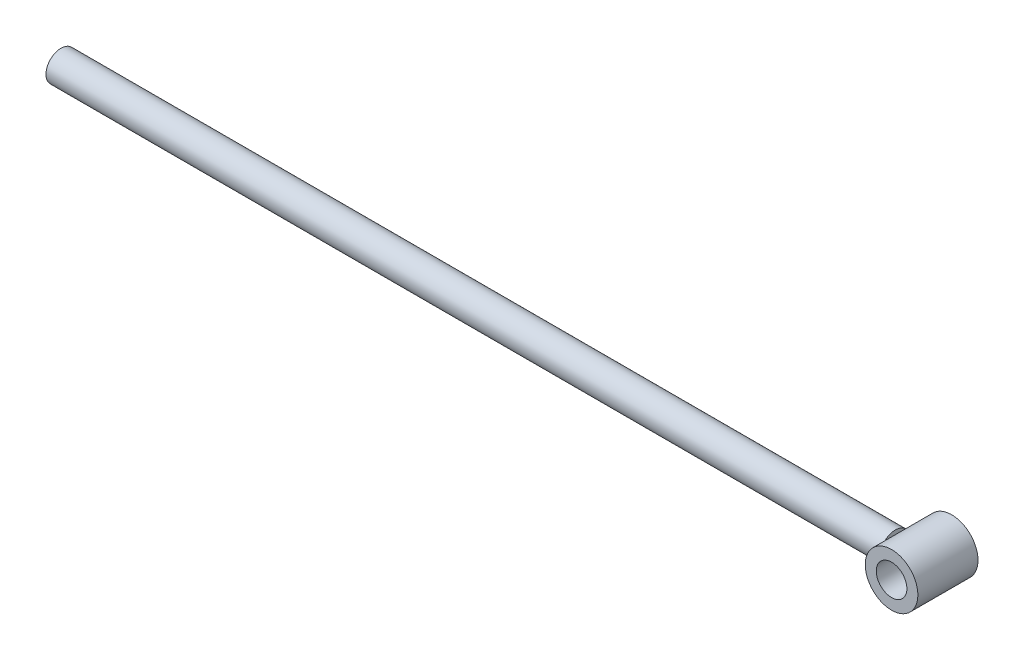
from build123d import *

# Parameters (mm, degrees)
ESQUISSE1_R      = 10
EXTRUSION1_DEPTH = 555
ESQUISSE2_R      = 17.5
ESQUISSE2_R_2    = 10.2
EXTRUSION2_DEPTH = 20


with BuildPart() as part:
    # Esquisse1 → Extrusion1 (new body)
    with BuildSketch(Plane(origin=(0, 0, 0), x_dir=(0, 0, -1), z_dir=(1, 0, 0))):
        Circle(ESQUISSE1_R)
    extrude(amount=EXTRUSION1_DEPTH)


with BuildPart() as body_2:
    # Esquisse2 → Extrusion2 (new, symmetric)
    with BuildSketch(Plane.XY):
        with Locations((572.5, 0)):
            Circle(ESQUISSE2_R)
        with Locations((572.5, 0)):
            Circle(ESQUISSE2_R_2, mode=Mode.SUBTRACT)
    extrude(amount=EXTRUSION2_DEPTH, both=True)


solid = Compound([part.part, body_2.part])
